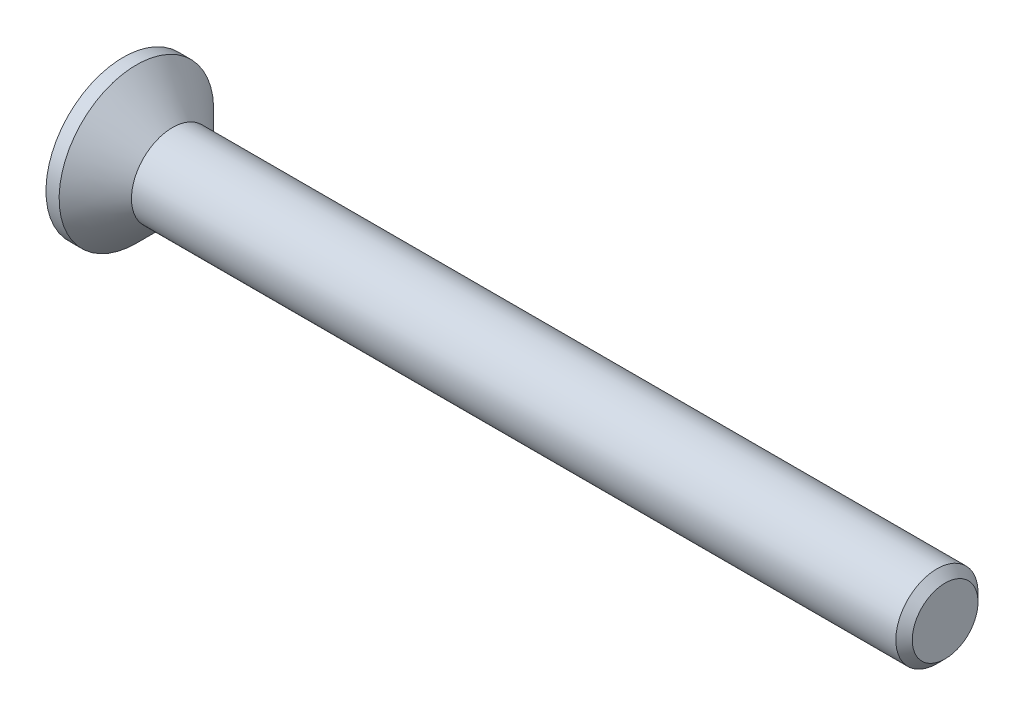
from build123d import *

# Parameters (mm, degrees)
CHAMFER1_SIZE      = 0.25
CUT_EXTRUDE1_DEPTH = 1.25


with BuildPart() as part:
    # Sketch1 → Revolve1 (revolve)
    with BuildSketch(Plane.XY, mode=Mode.PRIVATE) as revolve1_sk:
        Polygon((-1.5, 2.35), (-1.5, 0), (23.5, 0), (23.5, 1.25), (0, 1.25), (-1.1, 2.35), align=None)
    revolve(revolve1_sk.sketch.rotate(Axis((-1.5, 0, 0), (1, 0, 0)), 180), axis=Axis((-1.5, 0, 0), (1, 0, 0)))

    # Chamfer1
    chamfer1_edges = [part.edges().sort_by_distance(p)[0] for p in [
        (23.5, 1.25, 0),
    ]]
    chamfer(chamfer1_edges, length=CHAMFER1_SIZE)

    # Sketch2 → Cut-Extrude1 (cut)
    with BuildSketch(Plane.ZY.offset(1.5)):
        Polygon((-0.34, 1.35), (0.34, 1.35), (0.34, 0.34), (1.35, 0.34), (1.35, -0.34), (0.34, -0.34), (0.34, -1.35), (-0.34, -1.35), (-0.34, -0.34), (-1.35, -0.34), (-1.35, 0.34), (-0.34, 0.34), align=None)
    extrude(amount=-CUT_EXTRUDE1_DEPTH, mode=Mode.SUBTRACT)


solid = part.part
